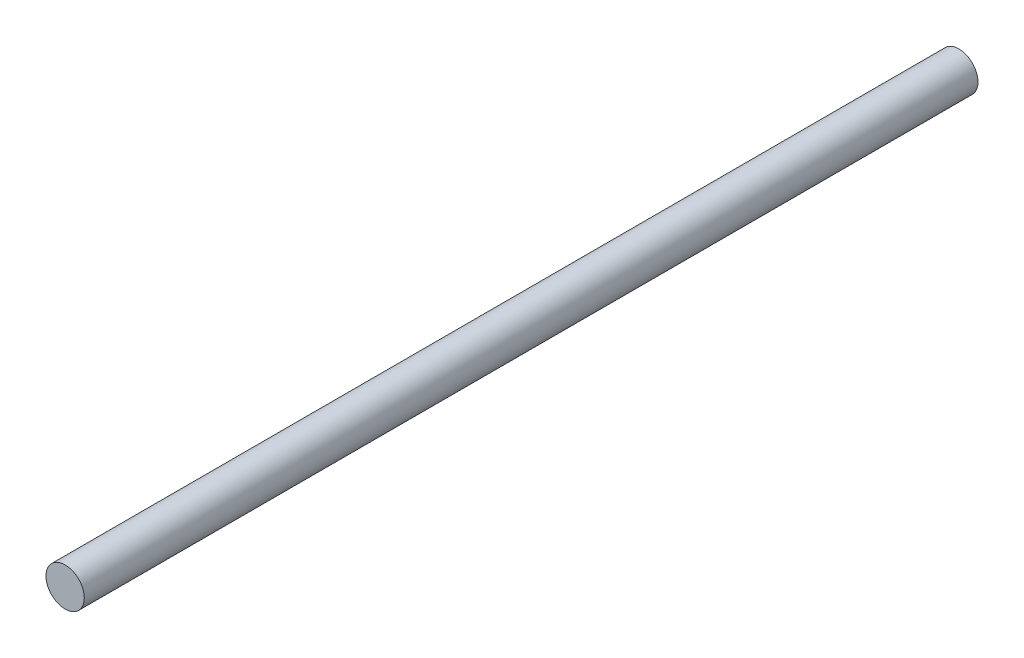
ISO-10303-21;
HEADER;
FILE_DESCRIPTION(('STEP AP214'),'2;1');
FILE_NAME('part.step','',(''),(''),'','','');
FILE_SCHEMA(('AUTOMOTIVE_DESIGN { 1 0 10303 214 1 1 1 1 }'));
ENDSEC;
DATA;
#1=APPLICATION_CONTEXT('core data for automotive mechanical design processes');
#2=APPLICATION_PROTOCOL_DEFINITION('international standard','automotive_design',2000,#1);
#3=PRODUCT_CONTEXT('',#1,'mechanical');
#4=PRODUCT('Part','Part','',(#3));
#5=PRODUCT_RELATED_PRODUCT_CATEGORY('part','',(#4));
#6=PRODUCT_DEFINITION_FORMATION('','',#4);
#7=PRODUCT_DEFINITION_CONTEXT('part definition',#1,'design');
#8=PRODUCT_DEFINITION('design','',#6,#7);
#9=PRODUCT_DEFINITION_SHAPE('','',#8);
#10=(LENGTH_UNIT() NAMED_UNIT(*) SI_UNIT(.MILLI.,.METRE.));
#11=(NAMED_UNIT(*) PLANE_ANGLE_UNIT() SI_UNIT($,.RADIAN.));
#12=(NAMED_UNIT(*) SI_UNIT($,.STERADIAN.) SOLID_ANGLE_UNIT());
#13=UNCERTAINTY_MEASURE_WITH_UNIT(LENGTH_MEASURE(1.E-05),#10,'distance_accuracy_value','');
#14=(GEOMETRIC_REPRESENTATION_CONTEXT(3) GLOBAL_UNCERTAINTY_ASSIGNED_CONTEXT((#13)) GLOBAL_UNIT_ASSIGNED_CONTEXT((#10,
#11,#12)) REPRESENTATION_CONTEXT('',''));
#15=CARTESIAN_POINT('',(0.,0.,0.));
#16=DIRECTION('',(0.,0.,1.));
#17=DIRECTION('',(1.,0.,0.));
#18=AXIS2_PLACEMENT_3D('',#15,#16,#17);
#19=CARTESIAN_POINT('',(0.,0.,-1400.));
#20=DIRECTION('',(0.,0.,1.));
#21=DIRECTION('',(1.,0.,0.));
#22=AXIS2_PLACEMENT_3D('',#19,#20,#21);
#23=CYLINDRICAL_SURFACE('',#22,30.);
#24=CARTESIAN_POINT('',(0.,0.,-1400.));
#25=DIRECTION('',(0.,0.,1.));
#26=DIRECTION('',(1.,0.,0.));
#27=AXIS2_PLACEMENT_3D('',#24,#25,#26);
#28=CIRCLE('',#27,30.);
#29=CARTESIAN_POINT('',(30.,0.,-1400.));
#30=VERTEX_POINT('',#29);
#31=EDGE_CURVE('E10',#30,#30,#28,.T.);
#32=ORIENTED_EDGE('',*,*,#31,.T.);
#33=EDGE_LOOP('',(#32));
#34=FACE_BOUND('',#33,.T.);
#35=CARTESIAN_POINT('',(0.,0.,0.));
#36=DIRECTION('',(0.,0.,1.));
#37=DIRECTION('',(1.,0.,0.));
#38=AXIS2_PLACEMENT_3D('',#35,#36,#37);
#39=CIRCLE('',#38,30.);
#40=CARTESIAN_POINT('',(30.,0.,0.));
#41=VERTEX_POINT('',#40);
#42=EDGE_CURVE('E40',#41,#41,#39,.T.);
#43=ORIENTED_EDGE('',*,*,#42,.F.);
#44=EDGE_LOOP('',(#43));
#45=FACE_BOUND('',#44,.T.);
#46=ADVANCED_FACE('F37',(#34,#45),#23,.T.);
#47=CARTESIAN_POINT('',(0.,0.,-1400.));
#48=DIRECTION('',(0.,0.,1.));
#49=DIRECTION('',(1.,0.,0.));
#50=AXIS2_PLACEMENT_3D('',#47,#48,#49);
#51=PLANE('',#50);
#52=ORIENTED_EDGE('',*,*,#31,.F.);
#53=EDGE_LOOP('',(#52));
#54=FACE_BOUND('',#53,.T.);
#55=ADVANCED_FACE('F54',(#54),#51,.F.);
#56=CARTESIAN_POINT('',(0.,0.,0.));
#57=DIRECTION('',(0.,0.,1.));
#58=DIRECTION('',(1.,0.,0.));
#59=AXIS2_PLACEMENT_3D('',#56,#57,#58);
#60=PLANE('',#59);
#61=ORIENTED_EDGE('',*,*,#42,.T.);
#62=EDGE_LOOP('',(#61));
#63=FACE_BOUND('',#62,.T.);
#64=ADVANCED_FACE('F51',(#63),#60,.T.);
#65=CLOSED_SHELL('',(#46,#55,#64));
#66=MANIFOLD_SOLID_BREP('B2',#65);
#67=ADVANCED_BREP_SHAPE_REPRESENTATION('',(#18,#66),#14);
#68=SHAPE_DEFINITION_REPRESENTATION(#9,#67);
ENDSEC;
END-ISO-10303-21;
